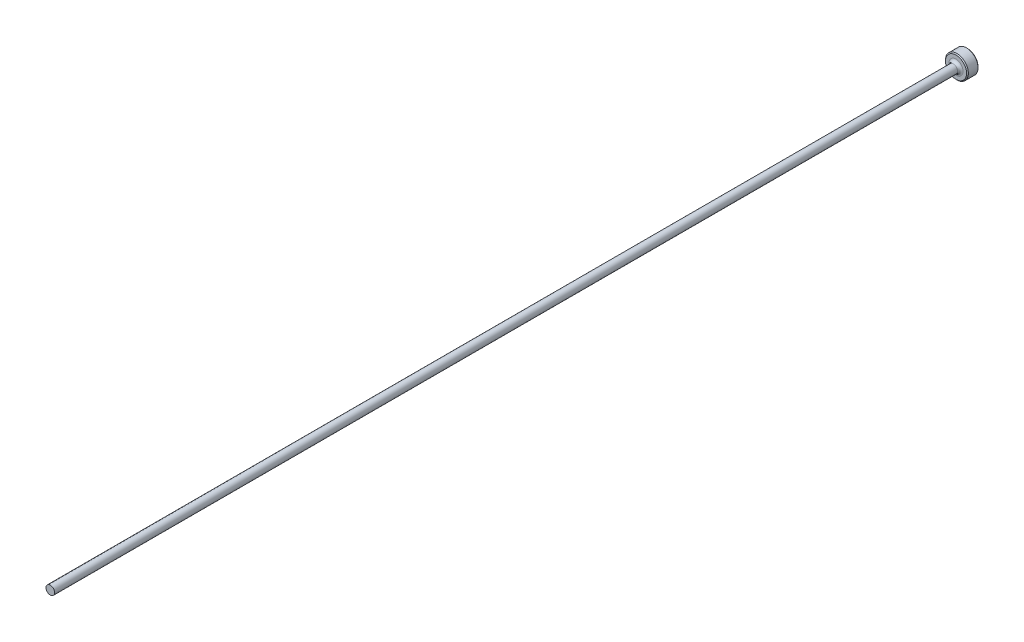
ISO-10303-21;
HEADER;
FILE_DESCRIPTION(('STEP AP214'),'2;1');
FILE_NAME('part.step','',(''),(''),'','','');
FILE_SCHEMA(('AUTOMOTIVE_DESIGN { 1 0 10303 214 1 1 1 1 }'));
ENDSEC;
DATA;
#1=APPLICATION_CONTEXT('core data for automotive mechanical design processes');
#2=APPLICATION_PROTOCOL_DEFINITION('international standard','automotive_design',2000,#1);
#3=PRODUCT_CONTEXT('',#1,'mechanical');
#4=PRODUCT('Part','Part','',(#3));
#5=PRODUCT_RELATED_PRODUCT_CATEGORY('part','',(#4));
#6=PRODUCT_DEFINITION_FORMATION('','',#4);
#7=PRODUCT_DEFINITION_CONTEXT('part definition',#1,'design');
#8=PRODUCT_DEFINITION('design','',#6,#7);
#9=PRODUCT_DEFINITION_SHAPE('','',#8);
#10=(LENGTH_UNIT() NAMED_UNIT(*) SI_UNIT(.MILLI.,.METRE.));
#11=(NAMED_UNIT(*) PLANE_ANGLE_UNIT() SI_UNIT($,.RADIAN.));
#12=(NAMED_UNIT(*) SI_UNIT($,.STERADIAN.) SOLID_ANGLE_UNIT());
#13=UNCERTAINTY_MEASURE_WITH_UNIT(LENGTH_MEASURE(1.E-05),#10,'distance_accuracy_value','');
#14=(GEOMETRIC_REPRESENTATION_CONTEXT(3) GLOBAL_UNCERTAINTY_ASSIGNED_CONTEXT((#13)) GLOBAL_UNIT_ASSIGNED_CONTEXT((#10,
#11,#12)) REPRESENTATION_CONTEXT('',''));
#15=CARTESIAN_POINT('',(0.,0.,0.));
#16=DIRECTION('',(0.,0.,1.));
#17=DIRECTION('',(1.,0.,0.));
#18=AXIS2_PLACEMENT_3D('',#15,#16,#17);
#19=CARTESIAN_POINT('',(0.,1.18998999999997,254.));
#20=DIRECTION('',(0.,0.,1.));
#21=DIRECTION('',(1.,0.,0.));
#22=AXIS2_PLACEMENT_3D('',#19,#20,#21);
#23=PLANE('',#22);
#24=CARTESIAN_POINT('',(0.,0.,254.));
#25=DIRECTION('',(0.,0.,-1.));
#26=DIRECTION('',(-1.,0.,0.));
#27=AXIS2_PLACEMENT_3D('',#24,#25,#26);
#28=CIRCLE('',#27,1.18998999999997);
#29=CARTESIAN_POINT('',(-1.18998999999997,0.,254.));
#30=VERTEX_POINT('',#29);
#31=EDGE_CURVE('E50',#30,#30,#28,.T.);
#32=ORIENTED_EDGE('',*,*,#31,.F.);
#33=EDGE_LOOP('',(#32));
#34=FACE_BOUND('',#33,.T.);
#35=ADVANCED_FACE('F30',(#34),#23,.T.);
#36=CARTESIAN_POINT('',(0.,0.,-25.4347445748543));
#37=DIRECTION('',(0.,0.,-1.));
#38=DIRECTION('',(-1.,0.,0.));
#39=AXIS2_PLACEMENT_3D('',#36,#37,#38);
#40=CYLINDRICAL_SURFACE('',#39,1.18998999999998);
#41=ORIENTED_EDGE('',*,*,#31,.T.);
#42=EDGE_LOOP('',(#41));
#43=FACE_BOUND('',#42,.T.);
#44=CARTESIAN_POINT('',(0.,0.,3.937));
#45=DIRECTION('',(0.,0.,-1.));
#46=DIRECTION('',(-1.,0.,0.));
#47=AXIS2_PLACEMENT_3D('',#44,#45,#46);
#48=CIRCLE('',#47,1.18999);
#49=CARTESIAN_POINT('',(-1.18999,0.,3.937));
#50=VERTEX_POINT('',#49);
#51=EDGE_CURVE('E53',#50,#50,#48,.T.);
#52=ORIENTED_EDGE('',*,*,#51,.F.);
#53=EDGE_LOOP('',(#52));
#54=FACE_BOUND('',#53,.T.);
#55=ADVANCED_FACE('F64',(#43,#54),#40,.T.);
#56=CARTESIAN_POINT('',(0.,0.,3.937));
#57=DIRECTION('',(0.,0.,-1.));
#58=DIRECTION('',(-1.,0.,0.));
#59=AXIS2_PLACEMENT_3D('',#56,#57,#58);
#60=TOROIDAL_SURFACE('',#59,1.95199,0.762);
#61=ORIENTED_EDGE('',*,*,#51,.T.);
#62=EDGE_LOOP('',(#61));
#63=FACE_BOUND('',#62,.T.);
#64=CARTESIAN_POINT('',(0.,0.,3.175));
#65=DIRECTION('',(0.,0.,-1.));
#66=DIRECTION('',(-1.,0.,0.));
#67=AXIS2_PLACEMENT_3D('',#64,#65,#66);
#68=CIRCLE('',#67,1.95199);
#69=CARTESIAN_POINT('',(-1.95199,0.,3.175));
#70=VERTEX_POINT('',#69);
#71=EDGE_CURVE('E56',#70,#70,#68,.T.);
#72=ORIENTED_EDGE('',*,*,#71,.F.);
#73=EDGE_LOOP('',(#72));
#74=FACE_BOUND('',#73,.T.);
#75=ADVANCED_FACE('F62',(#63,#74),#60,.F.);
#76=CARTESIAN_POINT('',(0.,3.175,3.175));
#77=DIRECTION('',(0.,0.,1.));
#78=DIRECTION('',(1.,0.,0.));
#79=AXIS2_PLACEMENT_3D('',#76,#77,#78);
#80=PLANE('',#79);
#81=CARTESIAN_POINT('',(0.,0.,3.175));
#82=DIRECTION('',(0.,0.,1.));
#83=DIRECTION('',(1.,0.,0.));
#84=AXIS2_PLACEMENT_3D('',#81,#82,#83);
#85=CIRCLE('',#84,2.92100000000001);
#86=CARTESIAN_POINT('',(2.92100000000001,0.,3.175));
#87=VERTEX_POINT('',#86);
#88=EDGE_CURVE('E10',#87,#87,#85,.T.);
#89=ORIENTED_EDGE('',*,*,#88,.T.);
#90=EDGE_LOOP('',(#89));
#91=FACE_BOUND('',#90,.T.);
#92=ORIENTED_EDGE('',*,*,#71,.T.);
#93=EDGE_LOOP('',(#92));
#94=FACE_BOUND('',#93,.T.);
#95=ADVANCED_FACE('F60',(#91,#94),#80,.T.);
#96=CARTESIAN_POINT('',(0.,0.,-25.4347445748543));
#97=DIRECTION('',(0.,0.,-1.));
#98=DIRECTION('',(-1.,0.,0.));
#99=AXIS2_PLACEMENT_3D('',#96,#97,#98);
#100=CYLINDRICAL_SURFACE('',#99,3.175);
#101=CARTESIAN_POINT('',(0.,0.,0.253999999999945));
#102=DIRECTION('',(0.,0.,-1.));
#103=DIRECTION('',(-1.,0.,0.));
#104=AXIS2_PLACEMENT_3D('',#101,#102,#103);
#105=CIRCLE('',#104,3.175);
#106=CARTESIAN_POINT('',(-3.175,0.,0.253999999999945));
#107=VERTEX_POINT('',#106);
#108=EDGE_CURVE('E37',#107,#107,#105,.F.);
#109=ORIENTED_EDGE('',*,*,#108,.T.);
#110=EDGE_LOOP('',(#109));
#111=FACE_BOUND('',#110,.T.);
#112=CARTESIAN_POINT('',(0.,0.,2.92100000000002));
#113=DIRECTION('',(0.,0.,1.));
#114=DIRECTION('',(1.,0.,0.));
#115=AXIS2_PLACEMENT_3D('',#112,#113,#114);
#116=CIRCLE('',#115,3.175);
#117=CARTESIAN_POINT('',(3.175,0.,2.92100000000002));
#118=VERTEX_POINT('',#117);
#119=EDGE_CURVE('E41',#118,#118,#116,.F.);
#120=ORIENTED_EDGE('',*,*,#119,.T.);
#121=EDGE_LOOP('',(#120));
#122=FACE_BOUND('',#121,.T.);
#123=ADVANCED_FACE('F71',(#111,#122),#100,.T.);
#124=CARTESIAN_POINT('',(0.,0.,0.));
#125=DIRECTION('',(0.,0.,-1.));
#126=DIRECTION('',(-1.,0.,0.));
#127=AXIS2_PLACEMENT_3D('',#124,#125,#126);
#128=PLANE('',#127);
#129=CARTESIAN_POINT('',(0.,0.,0.));
#130=DIRECTION('',(0.,0.,-1.));
#131=DIRECTION('',(-1.,0.,0.));
#132=AXIS2_PLACEMENT_3D('',#129,#130,#131);
#133=CIRCLE('',#132,2.92100000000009);
#134=CARTESIAN_POINT('',(-2.92100000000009,0.,0.));
#135=VERTEX_POINT('',#134);
#136=EDGE_CURVE('E45',#135,#135,#133,.T.);
#137=ORIENTED_EDGE('',*,*,#136,.T.);
#138=EDGE_LOOP('',(#137));
#139=FACE_BOUND('',#138,.T.);
#140=ADVANCED_FACE('F83',(#139),#128,.T.);
#141=CARTESIAN_POINT('',(0.,0.,0.));
#142=DIRECTION('',(0.,0.,1.));
#143=DIRECTION('',(1.,0.,0.));
#144=AXIS2_PLACEMENT_3D('',#141,#142,#143);
#145=CONICAL_SURFACE('',#144,2.92100000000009,0.78539816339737);
#146=ORIENTED_EDGE('',*,*,#108,.F.);
#147=EDGE_LOOP('',(#146));
#148=FACE_BOUND('',#147,.T.);
#149=ORIENTED_EDGE('',*,*,#136,.F.);
#150=EDGE_LOOP('',(#149));
#151=FACE_BOUND('',#150,.T.);
#152=ADVANCED_FACE('F81',(#148,#151),#145,.T.);
#153=CARTESIAN_POINT('',(0.,0.,2.92100000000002));
#154=DIRECTION('',(0.,0.,-1.));
#155=DIRECTION('',(-1.,0.,0.));
#156=AXIS2_PLACEMENT_3D('',#153,#154,#155);
#157=CONICAL_SURFACE('',#156,3.175,0.785398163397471);
#158=ORIENTED_EDGE('',*,*,#88,.F.);
#159=EDGE_LOOP('',(#158));
#160=FACE_BOUND('',#159,.T.);
#161=ORIENTED_EDGE('',*,*,#119,.F.);
#162=EDGE_LOOP('',(#161));
#163=FACE_BOUND('',#162,.T.);
#164=ADVANCED_FACE('F32',(#160,#163),#157,.T.);
#165=CLOSED_SHELL('',(#35,#55,#75,#95,#123,#140,#152,#164));
#166=MANIFOLD_SOLID_BREP('B2',#165);
#167=ADVANCED_BREP_SHAPE_REPRESENTATION('',(#18,#166),#14);
#168=SHAPE_DEFINITION_REPRESENTATION(#9,#167);
ENDSEC;
END-ISO-10303-21;
